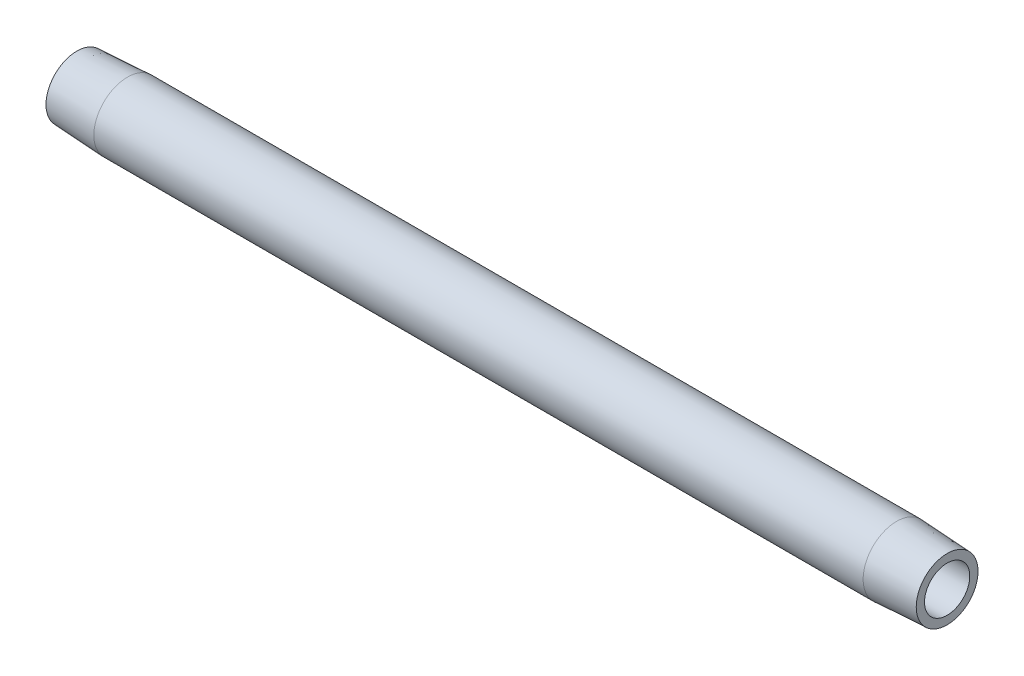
ISO-10303-21;
HEADER;
FILE_DESCRIPTION(('STEP AP214'),'2;1');
FILE_NAME('part.step','',(''),(''),'','','');
FILE_SCHEMA(('AUTOMOTIVE_DESIGN { 1 0 10303 214 1 1 1 1 }'));
ENDSEC;
DATA;
#1=APPLICATION_CONTEXT('core data for automotive mechanical design processes');
#2=APPLICATION_PROTOCOL_DEFINITION('international standard','automotive_design',2000,#1);
#3=PRODUCT_CONTEXT('',#1,'mechanical');
#4=PRODUCT('Part','Part','',(#3));
#5=PRODUCT_RELATED_PRODUCT_CATEGORY('part','',(#4));
#6=PRODUCT_DEFINITION_FORMATION('','',#4);
#7=PRODUCT_DEFINITION_CONTEXT('part definition',#1,'design');
#8=PRODUCT_DEFINITION('design','',#6,#7);
#9=PRODUCT_DEFINITION_SHAPE('','',#8);
#10=(LENGTH_UNIT() NAMED_UNIT(*) SI_UNIT(.MILLI.,.METRE.));
#11=(NAMED_UNIT(*) PLANE_ANGLE_UNIT() SI_UNIT($,.RADIAN.));
#12=(NAMED_UNIT(*) SI_UNIT($,.STERADIAN.) SOLID_ANGLE_UNIT());
#13=UNCERTAINTY_MEASURE_WITH_UNIT(LENGTH_MEASURE(1.E-05),#10,'distance_accuracy_value','');
#14=(GEOMETRIC_REPRESENTATION_CONTEXT(3) GLOBAL_UNCERTAINTY_ASSIGNED_CONTEXT((#13)) GLOBAL_UNIT_ASSIGNED_CONTEXT((#10,
#11,#12)) REPRESENTATION_CONTEXT('',''));
#15=CARTESIAN_POINT('',(0.,0.,0.));
#16=DIRECTION('',(0.,0.,1.));
#17=DIRECTION('',(1.,0.,0.));
#18=AXIS2_PLACEMENT_3D('',#15,#16,#17);
#19=CARTESIAN_POINT('',(177.8,0.,-4.62277681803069));
#20=DIRECTION('',(-1.,0.,0.));
#21=DIRECTION('',(0.,0.,1.));
#22=AXIS2_PLACEMENT_3D('',#19,#20,#21);
#23=PLANE('',#22);
#24=CARTESIAN_POINT('',(177.8,0.,0.));
#25=DIRECTION('',(-1.,0.,0.));
#26=DIRECTION('',(0.,0.,1.));
#27=AXIS2_PLACEMENT_3D('',#24,#25,#26);
#28=CIRCLE('',#27,6.31752683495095);
#29=CARTESIAN_POINT('',(177.8,0.,6.31752683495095));
#30=VERTEX_POINT('',#29);
#31=EDGE_CURVE('E10',#30,#30,#28,.T.);
#32=ORIENTED_EDGE('',*,*,#31,.F.);
#33=EDGE_LOOP('',(#32));
#34=FACE_BOUND('',#33,.T.);
#35=CARTESIAN_POINT('',(177.8,0.,0.));
#36=DIRECTION('',(-1.,0.,0.));
#37=DIRECTION('',(0.,0.,1.));
#38=AXIS2_PLACEMENT_3D('',#35,#36,#37);
#39=CIRCLE('',#38,4.62277681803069);
#40=CARTESIAN_POINT('',(177.8,0.,4.62277681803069));
#41=VERTEX_POINT('',#40);
#42=EDGE_CURVE('E52',#41,#41,#39,.T.);
#43=ORIENTED_EDGE('',*,*,#42,.T.);
#44=EDGE_LOOP('',(#43));
#45=FACE_BOUND('',#44,.T.);
#46=ADVANCED_FACE('F30',(#34,#45),#23,.F.);
#47=CARTESIAN_POINT('',(177.8,0.,0.));
#48=DIRECTION('',(-1.,0.,0.));
#49=DIRECTION('',(0.,0.,1.));
#50=AXIS2_PLACEMENT_3D('',#47,#48,#49);
#51=CONICAL_SURFACE('',#50,6.31752683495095,0.052359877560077);
#52=CARTESIAN_POINT('',(167.487600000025,0.,0.));
#53=DIRECTION('',(-1.,0.,0.));
#54=DIRECTION('',(0.,0.,1.));
#55=AXIS2_PLACEMENT_3D('',#52,#53,#54);
#56=CIRCLE('',#55,6.85797681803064);
#57=CARTESIAN_POINT('',(167.487600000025,0.,6.85797681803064));
#58=VERTEX_POINT('',#57);
#59=EDGE_CURVE('E36',#58,#58,#56,.T.);
#60=ORIENTED_EDGE('',*,*,#59,.F.);
#61=EDGE_LOOP('',(#60));
#62=FACE_BOUND('',#61,.T.);
#63=ORIENTED_EDGE('',*,*,#31,.T.);
#64=EDGE_LOOP('',(#63));
#65=FACE_BOUND('',#64,.T.);
#66=ADVANCED_FACE('F77',(#62,#65),#51,.T.);
#67=CARTESIAN_POINT('',(-6.37599469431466,0.,0.));
#68=DIRECTION('',(-1.,0.,0.));
#69=DIRECTION('',(0.,0.,1.));
#70=AXIS2_PLACEMENT_3D('',#67,#68,#69);
#71=CYLINDRICAL_SURFACE('',#70,6.85797681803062);
#72=CARTESIAN_POINT('',(10.3123999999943,0.,0.));
#73=DIRECTION('',(-1.,0.,0.));
#74=DIRECTION('',(0.,0.,1.));
#75=AXIS2_PLACEMENT_3D('',#72,#73,#74);
#76=CIRCLE('',#75,6.8579768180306);
#77=CARTESIAN_POINT('',(10.3123999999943,0.,6.8579768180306));
#78=VERTEX_POINT('',#77);
#79=EDGE_CURVE('E40',#78,#78,#76,.T.);
#80=ORIENTED_EDGE('',*,*,#79,.F.);
#81=EDGE_LOOP('',(#80));
#82=FACE_BOUND('',#81,.T.);
#83=ORIENTED_EDGE('',*,*,#59,.T.);
#84=EDGE_LOOP('',(#83));
#85=FACE_BOUND('',#84,.T.);
#86=ADVANCED_FACE('F72',(#82,#85),#71,.T.);
#87=CARTESIAN_POINT('',(10.3123999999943,0.,0.));
#88=DIRECTION('',(1.,0.,0.));
#89=DIRECTION('',(0.,0.,-1.));
#90=AXIS2_PLACEMENT_3D('',#87,#88,#89);
#91=CONICAL_SURFACE('',#90,6.8579768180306,0.0523598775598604);
#92=CARTESIAN_POINT('',(1.90819582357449E-11,0.,0.));
#93=DIRECTION('',(-1.,0.,0.));
#94=DIRECTION('',(0.,0.,1.));
#95=AXIS2_PLACEMENT_3D('',#92,#93,#94);
#96=CIRCLE('',#95,6.31752683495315);
#97=CARTESIAN_POINT('',(1.90819582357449E-11,0.,6.31752683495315));
#98=VERTEX_POINT('',#97);
#99=EDGE_CURVE('E44',#98,#98,#96,.T.);
#100=ORIENTED_EDGE('',*,*,#99,.F.);
#101=EDGE_LOOP('',(#100));
#102=FACE_BOUND('',#101,.T.);
#103=ORIENTED_EDGE('',*,*,#79,.T.);
#104=EDGE_LOOP('',(#103));
#105=FACE_BOUND('',#104,.T.);
#106=ADVANCED_FACE('F66',(#102,#105),#91,.T.);
#107=CARTESIAN_POINT('',(1.90819582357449E-11,0.,-6.31752683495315));
#108=DIRECTION('',(1.,0.,0.));
#109=DIRECTION('',(0.,0.,-1.));
#110=AXIS2_PLACEMENT_3D('',#107,#108,#109);
#111=PLANE('',#110);
#112=CARTESIAN_POINT('',(1.90819582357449E-11,0.,0.));
#113=DIRECTION('',(-1.,0.,0.));
#114=DIRECTION('',(0.,0.,1.));
#115=AXIS2_PLACEMENT_3D('',#112,#113,#114);
#116=CIRCLE('',#115,4.62277681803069);
#117=CARTESIAN_POINT('',(1.90819582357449E-11,0.,4.62277681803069));
#118=VERTEX_POINT('',#117);
#119=EDGE_CURVE('E49',#118,#118,#116,.T.);
#120=ORIENTED_EDGE('',*,*,#119,.F.);
#121=EDGE_LOOP('',(#120));
#122=FACE_BOUND('',#121,.T.);
#123=ORIENTED_EDGE('',*,*,#99,.T.);
#124=EDGE_LOOP('',(#123));
#125=FACE_BOUND('',#124,.T.);
#126=ADVANCED_FACE('F60',(#122,#125),#111,.F.);
#127=CARTESIAN_POINT('',(-6.37599469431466,0.,0.));
#128=DIRECTION('',(-1.,0.,0.));
#129=DIRECTION('',(0.,0.,1.));
#130=AXIS2_PLACEMENT_3D('',#127,#128,#129);
#131=CYLINDRICAL_SURFACE('',#130,4.62277681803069);
#132=ORIENTED_EDGE('',*,*,#42,.F.);
#133=EDGE_LOOP('',(#132));
#134=FACE_BOUND('',#133,.T.);
#135=ORIENTED_EDGE('',*,*,#119,.T.);
#136=EDGE_LOOP('',(#135));
#137=FACE_BOUND('',#136,.T.);
#138=ADVANCED_FACE('F57',(#134,#137),#131,.F.);
#139=CLOSED_SHELL('',(#46,#66,#86,#106,#126,#138));
#140=MANIFOLD_SOLID_BREP('B2',#139);
#141=ADVANCED_BREP_SHAPE_REPRESENTATION('',(#18,#140),#14);
#142=SHAPE_DEFINITION_REPRESENTATION(#9,#141);
ENDSEC;
END-ISO-10303-21;
